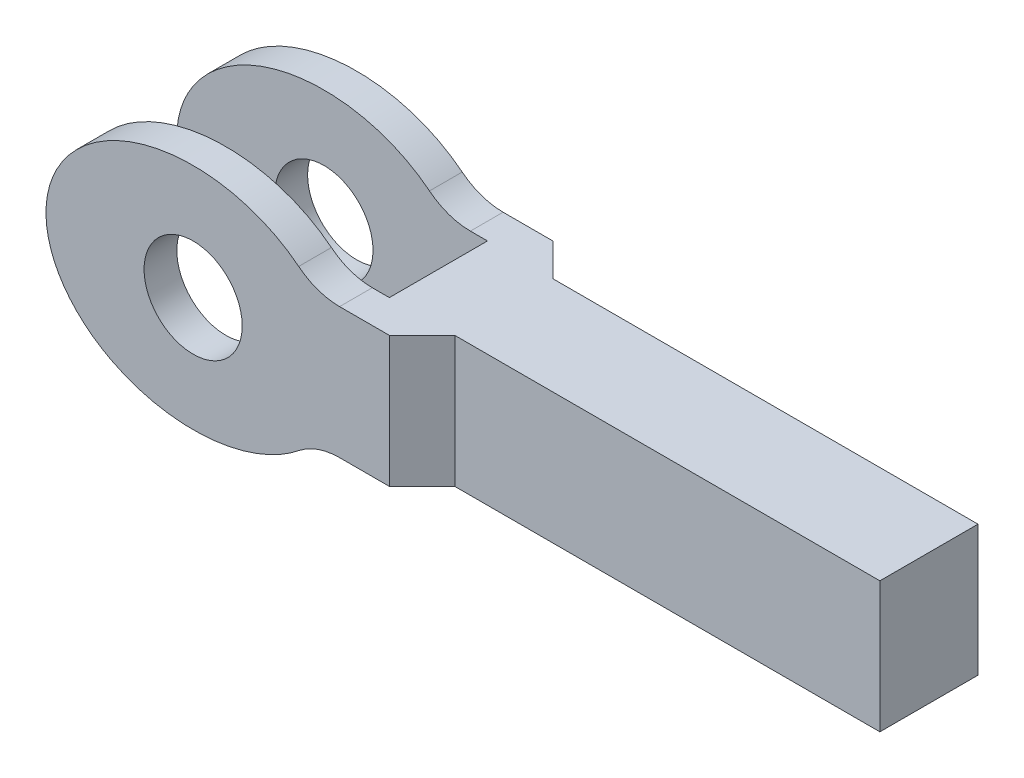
from build123d import *

# Parameters (mm, degrees)
SZKIC1_R                        = 1.5
DODANIE_WYCI_GNI_CIE1_DEPTH     = 2.5
WYTNIJ_WYCI_GNI_CIE1_DEPTH      = 21.457272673
WYTNIJ_WYCI_GNI_CIE1_DEPTH_BACK = 21.457272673
SZKIC2_W                        = 10
SZKIC2_H                        = 3
WYTNIJ_WYCI_GNI_CIE2_DEPTH      = 21.457272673
WYTNIJ_WYCI_GNI_CIE2_DEPTH_BACK = 21.457272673


with BuildPart() as part:
    # Szkic1 → Dodanie-wyci_gni_cie1 (new, symmetric)
    with BuildSketch(Plane.XY):
        with BuildLine():
            Line((4.477756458, 2), (20, 2))
            Line((20, 2), (20, -2))
            Line((20, -2), (4.477756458, -2))
            ThreePointArc((4.477756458, -2), (3.815369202, -2.112874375), (3.227748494, -2.438756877))
            add(Edge.make_bspline(
                [(3.227748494, 2.438756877), (-4.5, 8.62597206), (-4.5, 0), (-4.5, -8.62597206), (3.227748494, -2.438756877)],
                knots=[3.912501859, 3.912501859, 3.912501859, 6.283185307, 6.283185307, 8.653868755, 8.653868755, 8.653868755], degree=2, weights=[1, 0.375980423, 1, 0.375980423, 1]))
            ThreePointArc((3.227748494, 2.438756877), (3.815369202, 2.112874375), (4.477756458, 2))
        make_face()
        Circle(SZKIC1_R, mode=Mode.SUBTRACT)
    extrude(amount=DODANIE_WYCI_GNI_CIE1_DEPTH, both=True)

    # Szkic2 → Wytnij-wyci_gni_cie1 (cut, two sides: drawn at the far end of the back side and taken through both)
    with BuildSketch(Plane(origin=(0, 0, 0), x_dir=(1, 0, 0), z_dir=(0, 1, 0)).offset(-WYTNIJ_WYCI_GNI_CIE1_DEPTH_BACK)):
        Rectangle(SZKIC2_W, SZKIC2_H)
    extrude(amount=WYTNIJ_WYCI_GNI_CIE1_DEPTH + WYTNIJ_WYCI_GNI_CIE1_DEPTH_BACK, mode=Mode.SUBTRACT)

    # Szkic3 → Wytnij-wyci_gni_cie2 (cut, two sides: drawn at the far end of the back side and taken through both)
    with BuildSketch(Plane(origin=(0, 0, 0), x_dir=(1, 0, 0), z_dir=(0, 1, 0)).offset(-WYTNIJ_WYCI_GNI_CIE2_DEPTH_BACK)):
        Polygon((6, 2.5), (7, 1.5), (20, 1.5), (20, 2.5), align=None)
        Polygon((6, -2.5), (7, -1.5), (20, -1.5), (20, -2.5), align=None)
    extrude(amount=WYTNIJ_WYCI_GNI_CIE2_DEPTH + WYTNIJ_WYCI_GNI_CIE2_DEPTH_BACK, mode=Mode.SUBTRACT)


solid = part.part
